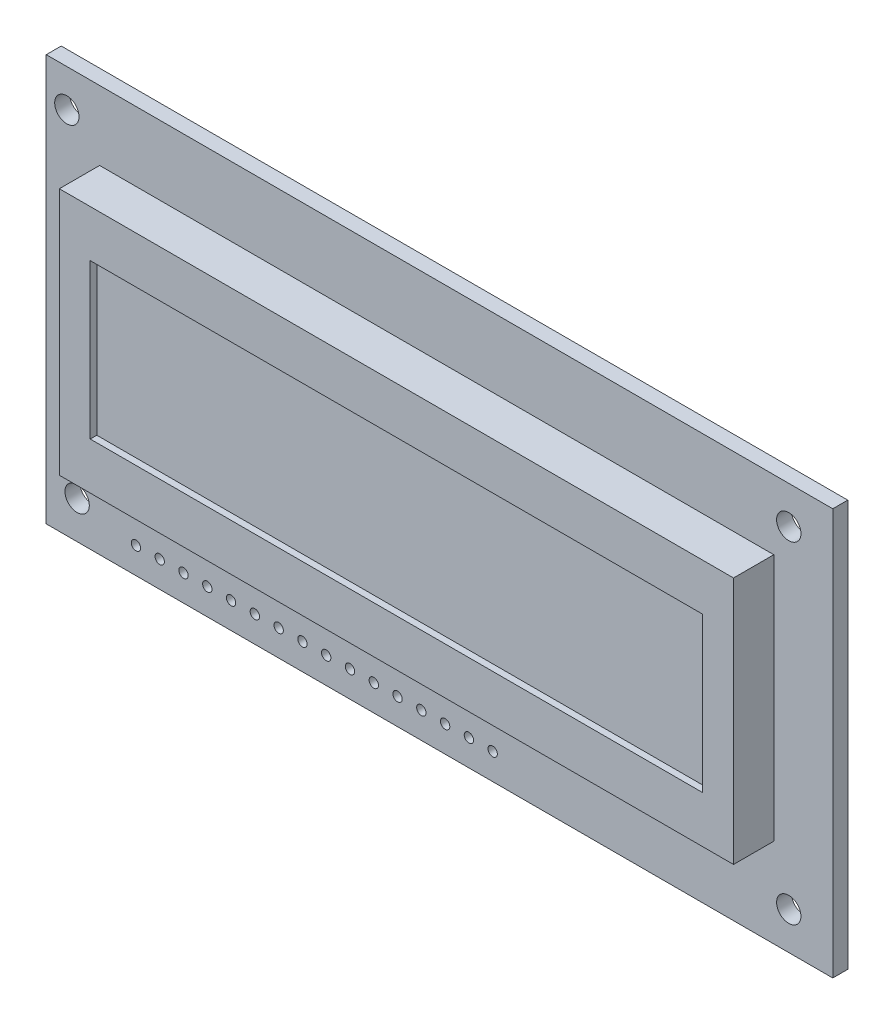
ISO-10303-21;
HEADER;
FILE_DESCRIPTION(('STEP AP214'),'2;1');
FILE_NAME('part.step','',(''),(''),'','','');
FILE_SCHEMA(('AUTOMOTIVE_DESIGN { 1 0 10303 214 1 1 1 1 }'));
ENDSEC;
DATA;
#1=APPLICATION_CONTEXT('core data for automotive mechanical design processes');
#2=APPLICATION_PROTOCOL_DEFINITION('international standard','automotive_design',2000,#1);
#3=PRODUCT_CONTEXT('',#1,'mechanical');
#4=PRODUCT('Part','Part','',(#3));
#5=PRODUCT_RELATED_PRODUCT_CATEGORY('part','',(#4));
#6=PRODUCT_DEFINITION_FORMATION('','',#4);
#7=PRODUCT_DEFINITION_CONTEXT('part definition',#1,'design');
#8=PRODUCT_DEFINITION('design','',#6,#7);
#9=PRODUCT_DEFINITION_SHAPE('','',#8);
#10=(LENGTH_UNIT() NAMED_UNIT(*) SI_UNIT(.MILLI.,.METRE.));
#11=(NAMED_UNIT(*) PLANE_ANGLE_UNIT() SI_UNIT($,.RADIAN.));
#12=(NAMED_UNIT(*) SI_UNIT($,.STERADIAN.) SOLID_ANGLE_UNIT());
#13=UNCERTAINTY_MEASURE_WITH_UNIT(LENGTH_MEASURE(1.E-05),#10,'distance_accuracy_value','');
#14=(GEOMETRIC_REPRESENTATION_CONTEXT(3) GLOBAL_UNCERTAINTY_ASSIGNED_CONTEXT((#13)) GLOBAL_UNIT_ASSIGNED_CONTEXT((#10,
#11,#12)) REPRESENTATION_CONTEXT('',''));
#15=CARTESIAN_POINT('',(0.,0.,0.));
#16=DIRECTION('',(0.,0.,1.));
#17=DIRECTION('',(1.,0.,0.));
#18=AXIS2_PLACEMENT_3D('',#15,#16,#17);
#19=CARTESIAN_POINT('',(92.2,43.4,1.6));
#20=DIRECTION('',(0.,0.,-1.));
#21=DIRECTION('',(-1.,0.,0.));
#22=AXIS2_PLACEMENT_3D('',#19,#20,#21);
#23=PLANE('',#22);
#24=CARTESIAN_POINT('',(55.88,2.8,1.6));
#25=DIRECTION('',(0.,0.,1.));
#26=DIRECTION('',(1.,0.,0.));
#27=AXIS2_PLACEMENT_3D('',#24,#25,#26);
#28=CIRCLE('',#27,0.499999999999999);
#29=CARTESIAN_POINT('',(56.38,2.8,1.6));
#30=VERTEX_POINT('',#29);
#31=EDGE_CURVE('E197',#30,#30,#28,.T.);
#32=ORIENTED_EDGE('',*,*,#31,.F.);
#33=EDGE_LOOP('',(#32));
#34=FACE_BOUND('',#33,.T.);
#35=CARTESIAN_POINT('',(50.8,2.8,1.6));
#36=DIRECTION('',(0.,0.,1.));
#37=DIRECTION('',(1.,0.,0.));
#38=AXIS2_PLACEMENT_3D('',#35,#36,#37);
#39=CIRCLE('',#38,0.499999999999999);
#40=CARTESIAN_POINT('',(51.3,2.8,1.6));
#41=VERTEX_POINT('',#40);
#42=EDGE_CURVE('E209',#41,#41,#39,.T.);
#43=ORIENTED_EDGE('',*,*,#42,.F.);
#44=EDGE_LOOP('',(#43));
#45=FACE_BOUND('',#44,.T.);
#46=CARTESIAN_POINT('',(45.72,2.8,1.6));
#47=DIRECTION('',(0.,0.,1.));
#48=DIRECTION('',(1.,0.,0.));
#49=AXIS2_PLACEMENT_3D('',#46,#47,#48);
#50=CIRCLE('',#49,0.499999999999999);
#51=CARTESIAN_POINT('',(46.22,2.8,1.6));
#52=VERTEX_POINT('',#51);
#53=EDGE_CURVE('E221',#52,#52,#50,.T.);
#54=ORIENTED_EDGE('',*,*,#53,.F.);
#55=EDGE_LOOP('',(#54));
#56=FACE_BOUND('',#55,.T.);
#57=CARTESIAN_POINT('',(40.64,2.8,1.6));
#58=DIRECTION('',(0.,0.,1.));
#59=DIRECTION('',(1.,0.,0.));
#60=AXIS2_PLACEMENT_3D('',#57,#58,#59);
#61=CIRCLE('',#60,0.499999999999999);
#62=CARTESIAN_POINT('',(41.14,2.8,1.6));
#63=VERTEX_POINT('',#62);
#64=EDGE_CURVE('E233',#63,#63,#61,.T.);
#65=ORIENTED_EDGE('',*,*,#64,.F.);
#66=EDGE_LOOP('',(#65));
#67=FACE_BOUND('',#66,.T.);
#68=CARTESIAN_POINT('',(35.56,2.8,1.6));
#69=DIRECTION('',(0.,0.,1.));
#70=DIRECTION('',(1.,0.,0.));
#71=AXIS2_PLACEMENT_3D('',#68,#69,#70);
#72=CIRCLE('',#71,0.499999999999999);
#73=CARTESIAN_POINT('',(36.06,2.8,1.6));
#74=VERTEX_POINT('',#73);
#75=EDGE_CURVE('E245',#74,#74,#72,.T.);
#76=ORIENTED_EDGE('',*,*,#75,.F.);
#77=EDGE_LOOP('',(#76));
#78=FACE_BOUND('',#77,.T.);
#79=CARTESIAN_POINT('',(30.48,2.8,1.6));
#80=DIRECTION('',(0.,0.,1.));
#81=DIRECTION('',(1.,0.,0.));
#82=AXIS2_PLACEMENT_3D('',#79,#80,#81);
#83=CIRCLE('',#82,0.499999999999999);
#84=CARTESIAN_POINT('',(30.98,2.8,1.6));
#85=VERTEX_POINT('',#84);
#86=EDGE_CURVE('E257',#85,#85,#83,.T.);
#87=ORIENTED_EDGE('',*,*,#86,.F.);
#88=EDGE_LOOP('',(#87));
#89=FACE_BOUND('',#88,.T.);
#90=CARTESIAN_POINT('',(25.4,2.8,1.6));
#91=DIRECTION('',(0.,0.,1.));
#92=DIRECTION('',(1.,0.,0.));
#93=AXIS2_PLACEMENT_3D('',#90,#91,#92);
#94=CIRCLE('',#93,0.499999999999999);
#95=CARTESIAN_POINT('',(25.9,2.8,1.6));
#96=VERTEX_POINT('',#95);
#97=EDGE_CURVE('E269',#96,#96,#94,.T.);
#98=ORIENTED_EDGE('',*,*,#97,.F.);
#99=EDGE_LOOP('',(#98));
#100=FACE_BOUND('',#99,.T.);
#101=CARTESIAN_POINT('',(20.32,2.8,1.6));
#102=DIRECTION('',(0.,0.,1.));
#103=DIRECTION('',(1.,0.,0.));
#104=AXIS2_PLACEMENT_3D('',#101,#102,#103);
#105=CIRCLE('',#104,0.499999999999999);
#106=CARTESIAN_POINT('',(20.82,2.8,1.6));
#107=VERTEX_POINT('',#106);
#108=EDGE_CURVE('E281',#107,#107,#105,.T.);
#109=ORIENTED_EDGE('',*,*,#108,.F.);
#110=EDGE_LOOP('',(#109));
#111=FACE_BOUND('',#110,.T.);
#112=CARTESIAN_POINT('',(87.5,39.4,1.6));
#113=DIRECTION('',(0.,0.,1.));
#114=DIRECTION('',(-1.,0.,0.));
#115=AXIS2_PLACEMENT_3D('',#112,#113,#114);
#116=CIRCLE('',#115,1.3);
#117=CARTESIAN_POINT('',(86.2,39.4,1.6));
#118=VERTEX_POINT('',#117);
#119=EDGE_CURVE('E293',#118,#118,#116,.T.);
#120=ORIENTED_EDGE('',*,*,#119,.F.);
#121=EDGE_LOOP('',(#120));
#122=FACE_BOUND('',#121,.T.);
#123=CARTESIAN_POINT('',(87.5,4.,1.6));
#124=DIRECTION('',(0.,0.,1.));
#125=DIRECTION('',(1.,0.,0.));
#126=AXIS2_PLACEMENT_3D('',#123,#124,#125);
#127=CIRCLE('',#126,1.29999999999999);
#128=CARTESIAN_POINT('',(88.8,4.,1.6));
#129=VERTEX_POINT('',#128);
#130=EDGE_CURVE('E305',#129,#129,#127,.T.);
#131=ORIENTED_EDGE('',*,*,#130,.F.);
#132=EDGE_LOOP('',(#131));
#133=FACE_BOUND('',#132,.T.);
#134=DIRECTION('',(0.,1.,0.));
#135=VECTOR('',#134,1.);
#136=CARTESIAN_POINT('',(92.2,0.,1.6));
#137=LINE('',#136,#135);
#138=CARTESIAN_POINT('',(92.2,0.,1.6));
#139=VERTEX_POINT('',#138);
#140=CARTESIAN_POINT('',(92.2,43.4,1.6));
#141=VERTEX_POINT('',#140);
#142=EDGE_CURVE('E323',#139,#141,#137,.T.);
#143=ORIENTED_EDGE('',*,*,#142,.T.);
#144=DIRECTION('',(-1.,0.,0.));
#145=VECTOR('',#144,1.);
#146=CARTESIAN_POINT('',(8.2,43.4,1.6));
#147=LINE('',#146,#145);
#148=CARTESIAN_POINT('',(8.2,43.4,1.6));
#149=VERTEX_POINT('',#148);
#150=EDGE_CURVE('E326',#141,#149,#147,.T.);
#151=ORIENTED_EDGE('',*,*,#150,.T.);
#152=DIRECTION('',(0.,-1.,0.));
#153=VECTOR('',#152,1.);
#154=CARTESIAN_POINT('',(8.2,43.4,1.6));
#155=LINE('',#154,#153);
#156=CARTESIAN_POINT('',(8.2,0.,1.6));
#157=VERTEX_POINT('',#156);
#158=EDGE_CURVE('E328',#149,#157,#155,.T.);
#159=ORIENTED_EDGE('',*,*,#158,.T.);
#160=DIRECTION('',(1.,0.,0.));
#161=VECTOR('',#160,1.);
#162=CARTESIAN_POINT('',(8.2,0.,1.6));
#163=LINE('',#162,#161);
#164=EDGE_CURVE('E330',#157,#139,#163,.T.);
#165=ORIENTED_EDGE('',*,*,#164,.T.);
#166=EDGE_LOOP('',(#143,#151,#159,#165));
#167=FACE_BOUND('',#166,.T.);
#168=CARTESIAN_POINT('',(11.5,4.,1.6));
#169=DIRECTION('',(0.,0.,1.));
#170=DIRECTION('',(1.,0.,0.));
#171=AXIS2_PLACEMENT_3D('',#168,#169,#170);
#172=CIRCLE('',#171,1.3);
#173=CARTESIAN_POINT('',(12.8,4.,1.6));
#174=VERTEX_POINT('',#173);
#175=EDGE_CURVE('E311',#174,#174,#172,.T.);
#176=ORIENTED_EDGE('',*,*,#175,.F.);
#177=EDGE_LOOP('',(#176));
#178=FACE_BOUND('',#177,.T.);
#179=CARTESIAN_POINT('',(10.4,39.3999999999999,1.6));
#180=DIRECTION('',(0.,0.,1.));
#181=DIRECTION('',(1.,0.,0.));
#182=AXIS2_PLACEMENT_3D('',#179,#180,#181);
#183=CIRCLE('',#182,1.3);
#184=CARTESIAN_POINT('',(11.7,39.3999999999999,1.6));
#185=VERTEX_POINT('',#184);
#186=EDGE_CURVE('E299',#185,#185,#183,.T.);
#187=ORIENTED_EDGE('',*,*,#186,.F.);
#188=EDGE_LOOP('',(#187));
#189=FACE_BOUND('',#188,.T.);
#190=CARTESIAN_POINT('',(17.78,2.8,1.6));
#191=DIRECTION('',(0.,0.,1.));
#192=DIRECTION('',(1.,0.,0.));
#193=AXIS2_PLACEMENT_3D('',#190,#191,#192);
#194=CIRCLE('',#193,0.499999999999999);
#195=CARTESIAN_POINT('',(18.28,2.8,1.6));
#196=VERTEX_POINT('',#195);
#197=EDGE_CURVE('E287',#196,#196,#194,.T.);
#198=ORIENTED_EDGE('',*,*,#197,.F.);
#199=EDGE_LOOP('',(#198));
#200=FACE_BOUND('',#199,.T.);
#201=CARTESIAN_POINT('',(22.86,2.8,1.6));
#202=DIRECTION('',(0.,0.,1.));
#203=DIRECTION('',(1.,0.,0.));
#204=AXIS2_PLACEMENT_3D('',#201,#202,#203);
#205=CIRCLE('',#204,0.499999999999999);
#206=CARTESIAN_POINT('',(23.36,2.8,1.6));
#207=VERTEX_POINT('',#206);
#208=EDGE_CURVE('E275',#207,#207,#205,.T.);
#209=ORIENTED_EDGE('',*,*,#208,.F.);
#210=EDGE_LOOP('',(#209));
#211=FACE_BOUND('',#210,.T.);
#212=CARTESIAN_POINT('',(27.94,2.8,1.6));
#213=DIRECTION('',(0.,0.,1.));
#214=DIRECTION('',(1.,0.,0.));
#215=AXIS2_PLACEMENT_3D('',#212,#213,#214);
#216=CIRCLE('',#215,0.499999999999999);
#217=CARTESIAN_POINT('',(28.44,2.8,1.6));
#218=VERTEX_POINT('',#217);
#219=EDGE_CURVE('E263',#218,#218,#216,.T.);
#220=ORIENTED_EDGE('',*,*,#219,.F.);
#221=EDGE_LOOP('',(#220));
#222=FACE_BOUND('',#221,.T.);
#223=CARTESIAN_POINT('',(33.02,2.8,1.6));
#224=DIRECTION('',(0.,0.,1.));
#225=DIRECTION('',(1.,0.,0.));
#226=AXIS2_PLACEMENT_3D('',#223,#224,#225);
#227=CIRCLE('',#226,0.499999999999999);
#228=CARTESIAN_POINT('',(33.52,2.8,1.6));
#229=VERTEX_POINT('',#228);
#230=EDGE_CURVE('E251',#229,#229,#227,.T.);
#231=ORIENTED_EDGE('',*,*,#230,.F.);
#232=EDGE_LOOP('',(#231));
#233=FACE_BOUND('',#232,.T.);
#234=CARTESIAN_POINT('',(38.1,2.8,1.6));
#235=DIRECTION('',(0.,0.,1.));
#236=DIRECTION('',(1.,0.,0.));
#237=AXIS2_PLACEMENT_3D('',#234,#235,#236);
#238=CIRCLE('',#237,0.499999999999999);
#239=CARTESIAN_POINT('',(38.6,2.8,1.6));
#240=VERTEX_POINT('',#239);
#241=EDGE_CURVE('E239',#240,#240,#238,.T.);
#242=ORIENTED_EDGE('',*,*,#241,.F.);
#243=EDGE_LOOP('',(#242));
#244=FACE_BOUND('',#243,.T.);
#245=CARTESIAN_POINT('',(43.18,2.8,1.6));
#246=DIRECTION('',(0.,0.,1.));
#247=DIRECTION('',(1.,0.,0.));
#248=AXIS2_PLACEMENT_3D('',#245,#246,#247);
#249=CIRCLE('',#248,0.499999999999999);
#250=CARTESIAN_POINT('',(43.68,2.8,1.6));
#251=VERTEX_POINT('',#250);
#252=EDGE_CURVE('E227',#251,#251,#249,.T.);
#253=ORIENTED_EDGE('',*,*,#252,.F.);
#254=EDGE_LOOP('',(#253));
#255=FACE_BOUND('',#254,.T.);
#256=CARTESIAN_POINT('',(48.26,2.8,1.6));
#257=DIRECTION('',(0.,0.,1.));
#258=DIRECTION('',(1.,0.,0.));
#259=AXIS2_PLACEMENT_3D('',#256,#257,#258);
#260=CIRCLE('',#259,0.499999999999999);
#261=CARTESIAN_POINT('',(48.76,2.8,1.6));
#262=VERTEX_POINT('',#261);
#263=EDGE_CURVE('E215',#262,#262,#260,.T.);
#264=ORIENTED_EDGE('',*,*,#263,.F.);
#265=EDGE_LOOP('',(#264));
#266=FACE_BOUND('',#265,.T.);
#267=CARTESIAN_POINT('',(53.34,2.8,1.6));
#268=DIRECTION('',(0.,0.,1.));
#269=DIRECTION('',(1.,0.,0.));
#270=AXIS2_PLACEMENT_3D('',#267,#268,#269);
#271=CIRCLE('',#270,0.499999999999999);
#272=CARTESIAN_POINT('',(53.84,2.8,1.6));
#273=VERTEX_POINT('',#272);
#274=EDGE_CURVE('E203',#273,#273,#271,.T.);
#275=ORIENTED_EDGE('',*,*,#274,.F.);
#276=EDGE_LOOP('',(#275));
#277=FACE_BOUND('',#276,.T.);
#278=DIRECTION('',(0.,-1.,0.));
#279=VECTOR('',#278,1.);
#280=CARTESIAN_POINT('',(13.9,36.,1.6));
#281=LINE('',#280,#279);
#282=CARTESIAN_POINT('',(13.9,36.,1.6));
#283=VERTEX_POINT('',#282);
#284=CARTESIAN_POINT('',(13.9,9.5,1.6));
#285=VERTEX_POINT('',#284);
#286=EDGE_CURVE('E162',#283,#285,#281,.T.);
#287=ORIENTED_EDGE('',*,*,#286,.F.);
#288=DIRECTION('',(-1.,0.,0.));
#289=VECTOR('',#288,1.);
#290=CARTESIAN_POINT('',(13.9,36.,1.6));
#291=LINE('',#290,#289);
#292=CARTESIAN_POINT('',(85.9,36.,1.6));
#293=VERTEX_POINT('',#292);
#294=EDGE_CURVE('E171',#293,#283,#291,.T.);
#295=ORIENTED_EDGE('',*,*,#294,.F.);
#296=DIRECTION('',(0.,1.,0.));
#297=VECTOR('',#296,1.);
#298=CARTESIAN_POINT('',(85.9,36.,1.6));
#299=LINE('',#298,#297);
#300=CARTESIAN_POINT('',(85.9,9.50000000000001,1.6));
#301=VERTEX_POINT('',#300);
#302=EDGE_CURVE('E168',#301,#293,#299,.T.);
#303=ORIENTED_EDGE('',*,*,#302,.F.);
#304=DIRECTION('',(1.,0.,0.));
#305=VECTOR('',#304,1.);
#306=CARTESIAN_POINT('',(13.9,9.50000000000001,1.6));
#307=LINE('',#306,#305);
#308=EDGE_CURVE('E58',#285,#301,#307,.T.);
#309=ORIENTED_EDGE('',*,*,#308,.F.);
#310=EDGE_LOOP('',(#287,#295,#303,#309));
#311=FACE_BOUND('',#310,.T.);
#312=ADVANCED_FACE('F35',(#34,#45,#56,#67,#78,#89,#100,#111,#122,#133,#167,#178,#189,#200,#211,
#222,#233,#244,#255,#266,#277,#311),#23,.F.);
#313=CARTESIAN_POINT('',(92.2,43.4,0.));
#314=DIRECTION('',(0.,0.,-1.));
#315=DIRECTION('',(-1.,0.,0.));
#316=AXIS2_PLACEMENT_3D('',#313,#314,#315);
#317=PLANE('',#316);
#318=CARTESIAN_POINT('',(53.34,2.8,0.));
#319=DIRECTION('',(0.,0.,1.));
#320=DIRECTION('',(1.,0.,0.));
#321=AXIS2_PLACEMENT_3D('',#318,#319,#320);
#322=CIRCLE('',#321,0.499999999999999);
#323=CARTESIAN_POINT('',(53.84,2.8,0.));
#324=VERTEX_POINT('',#323);
#325=EDGE_CURVE('E200',#324,#324,#322,.T.);
#326=ORIENTED_EDGE('',*,*,#325,.T.);
#327=EDGE_LOOP('',(#326));
#328=FACE_BOUND('',#327,.T.);
#329=CARTESIAN_POINT('',(48.26,2.8,0.));
#330=DIRECTION('',(0.,0.,1.));
#331=DIRECTION('',(1.,0.,0.));
#332=AXIS2_PLACEMENT_3D('',#329,#330,#331);
#333=CIRCLE('',#332,0.499999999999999);
#334=CARTESIAN_POINT('',(48.76,2.8,0.));
#335=VERTEX_POINT('',#334);
#336=EDGE_CURVE('E212',#335,#335,#333,.T.);
#337=ORIENTED_EDGE('',*,*,#336,.T.);
#338=EDGE_LOOP('',(#337));
#339=FACE_BOUND('',#338,.T.);
#340=CARTESIAN_POINT('',(43.18,2.8,0.));
#341=DIRECTION('',(0.,0.,1.));
#342=DIRECTION('',(1.,0.,0.));
#343=AXIS2_PLACEMENT_3D('',#340,#341,#342);
#344=CIRCLE('',#343,0.499999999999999);
#345=CARTESIAN_POINT('',(43.68,2.8,0.));
#346=VERTEX_POINT('',#345);
#347=EDGE_CURVE('E224',#346,#346,#344,.T.);
#348=ORIENTED_EDGE('',*,*,#347,.T.);
#349=EDGE_LOOP('',(#348));
#350=FACE_BOUND('',#349,.T.);
#351=CARTESIAN_POINT('',(38.1,2.8,0.));
#352=DIRECTION('',(0.,0.,1.));
#353=DIRECTION('',(1.,0.,0.));
#354=AXIS2_PLACEMENT_3D('',#351,#352,#353);
#355=CIRCLE('',#354,0.499999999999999);
#356=CARTESIAN_POINT('',(38.6,2.8,0.));
#357=VERTEX_POINT('',#356);
#358=EDGE_CURVE('E236',#357,#357,#355,.T.);
#359=ORIENTED_EDGE('',*,*,#358,.T.);
#360=EDGE_LOOP('',(#359));
#361=FACE_BOUND('',#360,.T.);
#362=CARTESIAN_POINT('',(33.02,2.8,0.));
#363=DIRECTION('',(0.,0.,1.));
#364=DIRECTION('',(1.,0.,0.));
#365=AXIS2_PLACEMENT_3D('',#362,#363,#364);
#366=CIRCLE('',#365,0.499999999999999);
#367=CARTESIAN_POINT('',(33.52,2.8,0.));
#368=VERTEX_POINT('',#367);
#369=EDGE_CURVE('E248',#368,#368,#366,.T.);
#370=ORIENTED_EDGE('',*,*,#369,.T.);
#371=EDGE_LOOP('',(#370));
#372=FACE_BOUND('',#371,.T.);
#373=CARTESIAN_POINT('',(27.94,2.8,0.));
#374=DIRECTION('',(0.,0.,1.));
#375=DIRECTION('',(1.,0.,0.));
#376=AXIS2_PLACEMENT_3D('',#373,#374,#375);
#377=CIRCLE('',#376,0.499999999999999);
#378=CARTESIAN_POINT('',(28.44,2.8,0.));
#379=VERTEX_POINT('',#378);
#380=EDGE_CURVE('E260',#379,#379,#377,.T.);
#381=ORIENTED_EDGE('',*,*,#380,.T.);
#382=EDGE_LOOP('',(#381));
#383=FACE_BOUND('',#382,.T.);
#384=CARTESIAN_POINT('',(22.86,2.8,0.));
#385=DIRECTION('',(0.,0.,1.));
#386=DIRECTION('',(1.,0.,0.));
#387=AXIS2_PLACEMENT_3D('',#384,#385,#386);
#388=CIRCLE('',#387,0.499999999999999);
#389=CARTESIAN_POINT('',(23.36,2.8,0.));
#390=VERTEX_POINT('',#389);
#391=EDGE_CURVE('E272',#390,#390,#388,.T.);
#392=ORIENTED_EDGE('',*,*,#391,.T.);
#393=EDGE_LOOP('',(#392));
#394=FACE_BOUND('',#393,.T.);
#395=CARTESIAN_POINT('',(17.78,2.8,0.));
#396=DIRECTION('',(0.,0.,1.));
#397=DIRECTION('',(1.,0.,0.));
#398=AXIS2_PLACEMENT_3D('',#395,#396,#397);
#399=CIRCLE('',#398,0.499999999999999);
#400=CARTESIAN_POINT('',(18.28,2.8,0.));
#401=VERTEX_POINT('',#400);
#402=EDGE_CURVE('E284',#401,#401,#399,.T.);
#403=ORIENTED_EDGE('',*,*,#402,.T.);
#404=EDGE_LOOP('',(#403));
#405=FACE_BOUND('',#404,.T.);
#406=CARTESIAN_POINT('',(10.4,39.3999999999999,0.));
#407=DIRECTION('',(0.,0.,1.));
#408=DIRECTION('',(1.,0.,0.));
#409=AXIS2_PLACEMENT_3D('',#406,#407,#408);
#410=CIRCLE('',#409,1.3);
#411=CARTESIAN_POINT('',(11.7,39.3999999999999,0.));
#412=VERTEX_POINT('',#411);
#413=EDGE_CURVE('E296',#412,#412,#410,.T.);
#414=ORIENTED_EDGE('',*,*,#413,.T.);
#415=EDGE_LOOP('',(#414));
#416=FACE_BOUND('',#415,.T.);
#417=CARTESIAN_POINT('',(11.5,4.,0.));
#418=DIRECTION('',(0.,0.,1.));
#419=DIRECTION('',(1.,0.,0.));
#420=AXIS2_PLACEMENT_3D('',#417,#418,#419);
#421=CIRCLE('',#420,1.3);
#422=CARTESIAN_POINT('',(12.8,4.,0.));
#423=VERTEX_POINT('',#422);
#424=EDGE_CURVE('E308',#423,#423,#421,.T.);
#425=ORIENTED_EDGE('',*,*,#424,.T.);
#426=EDGE_LOOP('',(#425));
#427=FACE_BOUND('',#426,.T.);
#428=DIRECTION('',(0.,1.,0.));
#429=VECTOR('',#428,1.);
#430=CARTESIAN_POINT('',(92.2,0.,0.));
#431=LINE('',#430,#429);
#432=CARTESIAN_POINT('',(92.2,0.,0.));
#433=VERTEX_POINT('',#432);
#434=CARTESIAN_POINT('',(92.2,43.4,0.));
#435=VERTEX_POINT('',#434);
#436=EDGE_CURVE('E314',#433,#435,#431,.T.);
#437=ORIENTED_EDGE('',*,*,#436,.F.);
#438=DIRECTION('',(1.,0.,0.));
#439=VECTOR('',#438,1.);
#440=CARTESIAN_POINT('',(8.2,0.,0.));
#441=LINE('',#440,#439);
#442=CARTESIAN_POINT('',(8.2,0.,0.));
#443=VERTEX_POINT('',#442);
#444=EDGE_CURVE('E321',#443,#433,#441,.T.);
#445=ORIENTED_EDGE('',*,*,#444,.F.);
#446=DIRECTION('',(0.,-1.,0.));
#447=VECTOR('',#446,1.);
#448=CARTESIAN_POINT('',(8.2,43.4,0.));
#449=LINE('',#448,#447);
#450=CARTESIAN_POINT('',(8.2,43.4,0.));
#451=VERTEX_POINT('',#450);
#452=EDGE_CURVE('E319',#451,#443,#449,.T.);
#453=ORIENTED_EDGE('',*,*,#452,.F.);
#454=DIRECTION('',(-1.,0.,0.));
#455=VECTOR('',#454,1.);
#456=CARTESIAN_POINT('',(8.2,43.4,0.));
#457=LINE('',#456,#455);
#458=EDGE_CURVE('E317',#435,#451,#457,.T.);
#459=ORIENTED_EDGE('',*,*,#458,.F.);
#460=EDGE_LOOP('',(#437,#445,#453,#459));
#461=FACE_BOUND('',#460,.T.);
#462=CARTESIAN_POINT('',(87.5,4.,0.));
#463=DIRECTION('',(0.,0.,1.));
#464=DIRECTION('',(1.,0.,0.));
#465=AXIS2_PLACEMENT_3D('',#462,#463,#464);
#466=CIRCLE('',#465,1.29999999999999);
#467=CARTESIAN_POINT('',(88.8,4.,0.));
#468=VERTEX_POINT('',#467);
#469=EDGE_CURVE('E302',#468,#468,#466,.T.);
#470=ORIENTED_EDGE('',*,*,#469,.T.);
#471=EDGE_LOOP('',(#470));
#472=FACE_BOUND('',#471,.T.);
#473=CARTESIAN_POINT('',(87.5,39.4,0.));
#474=DIRECTION('',(0.,0.,1.));
#475=DIRECTION('',(-1.,0.,0.));
#476=AXIS2_PLACEMENT_3D('',#473,#474,#475);
#477=CIRCLE('',#476,1.3);
#478=CARTESIAN_POINT('',(86.2,39.4,0.));
#479=VERTEX_POINT('',#478);
#480=EDGE_CURVE('E290',#479,#479,#477,.T.);
#481=ORIENTED_EDGE('',*,*,#480,.T.);
#482=EDGE_LOOP('',(#481));
#483=FACE_BOUND('',#482,.T.);
#484=CARTESIAN_POINT('',(20.32,2.8,0.));
#485=DIRECTION('',(0.,0.,1.));
#486=DIRECTION('',(1.,0.,0.));
#487=AXIS2_PLACEMENT_3D('',#484,#485,#486);
#488=CIRCLE('',#487,0.499999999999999);
#489=CARTESIAN_POINT('',(20.82,2.8,0.));
#490=VERTEX_POINT('',#489);
#491=EDGE_CURVE('E278',#490,#490,#488,.T.);
#492=ORIENTED_EDGE('',*,*,#491,.T.);
#493=EDGE_LOOP('',(#492));
#494=FACE_BOUND('',#493,.T.);
#495=CARTESIAN_POINT('',(25.4,2.8,0.));
#496=DIRECTION('',(0.,0.,1.));
#497=DIRECTION('',(1.,0.,0.));
#498=AXIS2_PLACEMENT_3D('',#495,#496,#497);
#499=CIRCLE('',#498,0.499999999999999);
#500=CARTESIAN_POINT('',(25.9,2.8,0.));
#501=VERTEX_POINT('',#500);
#502=EDGE_CURVE('E266',#501,#501,#499,.T.);
#503=ORIENTED_EDGE('',*,*,#502,.T.);
#504=EDGE_LOOP('',(#503));
#505=FACE_BOUND('',#504,.T.);
#506=CARTESIAN_POINT('',(30.48,2.8,0.));
#507=DIRECTION('',(0.,0.,1.));
#508=DIRECTION('',(1.,0.,0.));
#509=AXIS2_PLACEMENT_3D('',#506,#507,#508);
#510=CIRCLE('',#509,0.499999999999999);
#511=CARTESIAN_POINT('',(30.98,2.8,0.));
#512=VERTEX_POINT('',#511);
#513=EDGE_CURVE('E254',#512,#512,#510,.T.);
#514=ORIENTED_EDGE('',*,*,#513,.T.);
#515=EDGE_LOOP('',(#514));
#516=FACE_BOUND('',#515,.T.);
#517=CARTESIAN_POINT('',(35.56,2.8,0.));
#518=DIRECTION('',(0.,0.,1.));
#519=DIRECTION('',(1.,0.,0.));
#520=AXIS2_PLACEMENT_3D('',#517,#518,#519);
#521=CIRCLE('',#520,0.499999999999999);
#522=CARTESIAN_POINT('',(36.06,2.8,0.));
#523=VERTEX_POINT('',#522);
#524=EDGE_CURVE('E242',#523,#523,#521,.T.);
#525=ORIENTED_EDGE('',*,*,#524,.T.);
#526=EDGE_LOOP('',(#525));
#527=FACE_BOUND('',#526,.T.);
#528=CARTESIAN_POINT('',(40.64,2.8,0.));
#529=DIRECTION('',(0.,0.,1.));
#530=DIRECTION('',(1.,0.,0.));
#531=AXIS2_PLACEMENT_3D('',#528,#529,#530);
#532=CIRCLE('',#531,0.499999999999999);
#533=CARTESIAN_POINT('',(41.14,2.8,0.));
#534=VERTEX_POINT('',#533);
#535=EDGE_CURVE('E230',#534,#534,#532,.T.);
#536=ORIENTED_EDGE('',*,*,#535,.T.);
#537=EDGE_LOOP('',(#536));
#538=FACE_BOUND('',#537,.T.);
#539=CARTESIAN_POINT('',(45.72,2.8,0.));
#540=DIRECTION('',(0.,0.,1.));
#541=DIRECTION('',(1.,0.,0.));
#542=AXIS2_PLACEMENT_3D('',#539,#540,#541);
#543=CIRCLE('',#542,0.499999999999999);
#544=CARTESIAN_POINT('',(46.22,2.8,0.));
#545=VERTEX_POINT('',#544);
#546=EDGE_CURVE('E218',#545,#545,#543,.T.);
#547=ORIENTED_EDGE('',*,*,#546,.T.);
#548=EDGE_LOOP('',(#547));
#549=FACE_BOUND('',#548,.T.);
#550=CARTESIAN_POINT('',(50.8,2.8,0.));
#551=DIRECTION('',(0.,0.,1.));
#552=DIRECTION('',(1.,0.,0.));
#553=AXIS2_PLACEMENT_3D('',#550,#551,#552);
#554=CIRCLE('',#553,0.499999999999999);
#555=CARTESIAN_POINT('',(51.3,2.8,0.));
#556=VERTEX_POINT('',#555);
#557=EDGE_CURVE('E206',#556,#556,#554,.T.);
#558=ORIENTED_EDGE('',*,*,#557,.T.);
#559=EDGE_LOOP('',(#558));
#560=FACE_BOUND('',#559,.T.);
#561=CARTESIAN_POINT('',(55.88,2.8,0.));
#562=DIRECTION('',(0.,0.,1.));
#563=DIRECTION('',(1.,0.,0.));
#564=AXIS2_PLACEMENT_3D('',#561,#562,#563);
#565=CIRCLE('',#564,0.499999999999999);
#566=CARTESIAN_POINT('',(56.38,2.8,0.));
#567=VERTEX_POINT('',#566);
#568=EDGE_CURVE('E194',#567,#567,#565,.T.);
#569=ORIENTED_EDGE('',*,*,#568,.T.);
#570=EDGE_LOOP('',(#569));
#571=FACE_BOUND('',#570,.T.);
#572=ADVANCED_FACE('F348',(#328,#339,#350,#361,#372,#383,#394,#405,#416,#427,#461,#472,#483,
#494,#505,#516,#527,#538,#549,#560,#571),#317,.T.);
#573=CARTESIAN_POINT('',(92.2,0.,1.6));
#574=DIRECTION('',(-1.,0.,0.));
#575=DIRECTION('',(0.,0.,1.));
#576=AXIS2_PLACEMENT_3D('',#573,#574,#575);
#577=PLANE('',#576);
#578=ORIENTED_EDGE('',*,*,#436,.T.);
#579=DIRECTION('',(0.,0.,-1.));
#580=VECTOR('',#579,1.);
#581=CARTESIAN_POINT('',(92.2,43.4,1.6));
#582=LINE('',#581,#580);
#583=EDGE_CURVE('E11',#141,#435,#582,.T.);
#584=ORIENTED_EDGE('',*,*,#583,.F.);
#585=ORIENTED_EDGE('',*,*,#142,.F.);
#586=DIRECTION('',(0.,0.,-1.));
#587=VECTOR('',#586,1.);
#588=CARTESIAN_POINT('',(92.2,0.,1.6));
#589=LINE('',#588,#587);
#590=EDGE_CURVE('E332',#139,#433,#589,.T.);
#591=ORIENTED_EDGE('',*,*,#590,.T.);
#592=EDGE_LOOP('',(#578,#584,#585,#591));
#593=FACE_BOUND('',#592,.T.);
#594=ADVANCED_FACE('F37',(#593),#577,.F.);
#595=CARTESIAN_POINT('',(8.2,43.4,1.6));
#596=DIRECTION('',(0.,-1.,0.));
#597=DIRECTION('',(0.,0.,-1.));
#598=AXIS2_PLACEMENT_3D('',#595,#596,#597);
#599=PLANE('',#598);
#600=ORIENTED_EDGE('',*,*,#458,.T.);
#601=DIRECTION('',(0.,0.,-1.));
#602=VECTOR('',#601,1.);
#603=CARTESIAN_POINT('',(8.2,43.4,1.6));
#604=LINE('',#603,#602);
#605=EDGE_CURVE('E43',#149,#451,#604,.T.);
#606=ORIENTED_EDGE('',*,*,#605,.F.);
#607=ORIENTED_EDGE('',*,*,#150,.F.);
#608=ORIENTED_EDGE('',*,*,#583,.T.);
#609=EDGE_LOOP('',(#600,#606,#607,#608));
#610=FACE_BOUND('',#609,.T.);
#611=ADVANCED_FACE('F359',(#610),#599,.F.);
#612=CARTESIAN_POINT('',(8.2,43.4,1.6));
#613=DIRECTION('',(1.,0.,0.));
#614=DIRECTION('',(0.,0.,-1.));
#615=AXIS2_PLACEMENT_3D('',#612,#613,#614);
#616=PLANE('',#615);
#617=ORIENTED_EDGE('',*,*,#452,.T.);
#618=DIRECTION('',(0.,0.,-1.));
#619=VECTOR('',#618,1.);
#620=CARTESIAN_POINT('',(8.2,0.,1.6));
#621=LINE('',#620,#619);
#622=EDGE_CURVE('E335',#157,#443,#621,.T.);
#623=ORIENTED_EDGE('',*,*,#622,.F.);
#624=ORIENTED_EDGE('',*,*,#158,.F.);
#625=ORIENTED_EDGE('',*,*,#605,.T.);
#626=EDGE_LOOP('',(#617,#623,#624,#625));
#627=FACE_BOUND('',#626,.T.);
#628=ADVANCED_FACE('F342',(#627),#616,.F.);
#629=CARTESIAN_POINT('',(8.2,0.,1.6));
#630=DIRECTION('',(0.,1.,0.));
#631=DIRECTION('',(0.,0.,1.));
#632=AXIS2_PLACEMENT_3D('',#629,#630,#631);
#633=PLANE('',#632);
#634=ORIENTED_EDGE('',*,*,#444,.T.);
#635=ORIENTED_EDGE('',*,*,#590,.F.);
#636=ORIENTED_EDGE('',*,*,#164,.F.);
#637=ORIENTED_EDGE('',*,*,#622,.T.);
#638=EDGE_LOOP('',(#634,#635,#636,#637));
#639=FACE_BOUND('',#638,.T.);
#640=ADVANCED_FACE('F352',(#639),#633,.F.);
#641=CARTESIAN_POINT('',(11.5,4.,1.6));
#642=DIRECTION('',(0.,0.,-1.));
#643=DIRECTION('',(-1.,0.,0.));
#644=AXIS2_PLACEMENT_3D('',#641,#642,#643);
#645=CYLINDRICAL_SURFACE('',#644,1.3);
#646=ORIENTED_EDGE('',*,*,#175,.T.);
#647=EDGE_LOOP('',(#646));
#648=FACE_BOUND('',#647,.T.);
#649=ORIENTED_EDGE('',*,*,#424,.F.);
#650=EDGE_LOOP('',(#649));
#651=FACE_BOUND('',#650,.T.);
#652=ADVANCED_FACE('F379',(#648,#651),#645,.F.);
#653=CARTESIAN_POINT('',(87.5,4.,1.6));
#654=DIRECTION('',(0.,0.,-1.));
#655=DIRECTION('',(-1.,0.,0.));
#656=AXIS2_PLACEMENT_3D('',#653,#654,#655);
#657=CYLINDRICAL_SURFACE('',#656,1.29999999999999);
#658=ORIENTED_EDGE('',*,*,#130,.T.);
#659=EDGE_LOOP('',(#658));
#660=FACE_BOUND('',#659,.T.);
#661=ORIENTED_EDGE('',*,*,#469,.F.);
#662=EDGE_LOOP('',(#661));
#663=FACE_BOUND('',#662,.T.);
#664=ADVANCED_FACE('F383',(#660,#663),#657,.F.);
#665=CARTESIAN_POINT('',(10.4,39.3999999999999,1.6));
#666=DIRECTION('',(0.,0.,-1.));
#667=DIRECTION('',(-1.,0.,0.));
#668=AXIS2_PLACEMENT_3D('',#665,#666,#667);
#669=CYLINDRICAL_SURFACE('',#668,1.3);
#670=ORIENTED_EDGE('',*,*,#186,.T.);
#671=EDGE_LOOP('',(#670));
#672=FACE_BOUND('',#671,.T.);
#673=ORIENTED_EDGE('',*,*,#413,.F.);
#674=EDGE_LOOP('',(#673));
#675=FACE_BOUND('',#674,.T.);
#676=ADVANCED_FACE('F388',(#672,#675),#669,.F.);
#677=CARTESIAN_POINT('',(87.5,39.4,1.6));
#678=DIRECTION('',(0.,0.,-1.));
#679=DIRECTION('',(-1.,0.,0.));
#680=AXIS2_PLACEMENT_3D('',#677,#678,#679);
#681=CYLINDRICAL_SURFACE('',#680,1.3);
#682=ORIENTED_EDGE('',*,*,#119,.T.);
#683=EDGE_LOOP('',(#682));
#684=FACE_BOUND('',#683,.T.);
#685=ORIENTED_EDGE('',*,*,#480,.F.);
#686=EDGE_LOOP('',(#685));
#687=FACE_BOUND('',#686,.T.);
#688=ADVANCED_FACE('F395',(#684,#687),#681,.F.);
#689=CARTESIAN_POINT('',(17.78,2.8,1.6));
#690=DIRECTION('',(0.,0.,-1.));
#691=DIRECTION('',(-1.,0.,0.));
#692=AXIS2_PLACEMENT_3D('',#689,#690,#691);
#693=CYLINDRICAL_SURFACE('',#692,0.499999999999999);
#694=ORIENTED_EDGE('',*,*,#197,.T.);
#695=EDGE_LOOP('',(#694));
#696=FACE_BOUND('',#695,.T.);
#697=ORIENTED_EDGE('',*,*,#402,.F.);
#698=EDGE_LOOP('',(#697));
#699=FACE_BOUND('',#698,.T.);
#700=ADVANCED_FACE('F399',(#696,#699),#693,.F.);
#701=CARTESIAN_POINT('',(20.32,2.8,1.6));
#702=DIRECTION('',(0.,0.,-1.));
#703=DIRECTION('',(-1.,0.,0.));
#704=AXIS2_PLACEMENT_3D('',#701,#702,#703);
#705=CYLINDRICAL_SURFACE('',#704,0.499999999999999);
#706=ORIENTED_EDGE('',*,*,#108,.T.);
#707=EDGE_LOOP('',(#706));
#708=FACE_BOUND('',#707,.T.);
#709=ORIENTED_EDGE('',*,*,#491,.F.);
#710=EDGE_LOOP('',(#709));
#711=FACE_BOUND('',#710,.T.);
#712=ADVANCED_FACE('F403',(#708,#711),#705,.F.);
#713=CARTESIAN_POINT('',(22.86,2.8,1.6));
#714=DIRECTION('',(0.,0.,-1.));
#715=DIRECTION('',(-1.,0.,0.));
#716=AXIS2_PLACEMENT_3D('',#713,#714,#715);
#717=CYLINDRICAL_SURFACE('',#716,0.499999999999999);
#718=ORIENTED_EDGE('',*,*,#208,.T.);
#719=EDGE_LOOP('',(#718));
#720=FACE_BOUND('',#719,.T.);
#721=ORIENTED_EDGE('',*,*,#391,.F.);
#722=EDGE_LOOP('',(#721));
#723=FACE_BOUND('',#722,.T.);
#724=ADVANCED_FACE('F407',(#720,#723),#717,.F.);
#725=CARTESIAN_POINT('',(25.4,2.8,1.6));
#726=DIRECTION('',(0.,0.,-1.));
#727=DIRECTION('',(-1.,0.,0.));
#728=AXIS2_PLACEMENT_3D('',#725,#726,#727);
#729=CYLINDRICAL_SURFACE('',#728,0.499999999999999);
#730=ORIENTED_EDGE('',*,*,#97,.T.);
#731=EDGE_LOOP('',(#730));
#732=FACE_BOUND('',#731,.T.);
#733=ORIENTED_EDGE('',*,*,#502,.F.);
#734=EDGE_LOOP('',(#733));
#735=FACE_BOUND('',#734,.T.);
#736=ADVANCED_FACE('F411',(#732,#735),#729,.F.);
#737=CARTESIAN_POINT('',(27.94,2.8,1.6));
#738=DIRECTION('',(0.,0.,-1.));
#739=DIRECTION('',(-1.,0.,0.));
#740=AXIS2_PLACEMENT_3D('',#737,#738,#739);
#741=CYLINDRICAL_SURFACE('',#740,0.499999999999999);
#742=ORIENTED_EDGE('',*,*,#219,.T.);
#743=EDGE_LOOP('',(#742));
#744=FACE_BOUND('',#743,.T.);
#745=ORIENTED_EDGE('',*,*,#380,.F.);
#746=EDGE_LOOP('',(#745));
#747=FACE_BOUND('',#746,.T.);
#748=ADVANCED_FACE('F415',(#744,#747),#741,.F.);
#749=CARTESIAN_POINT('',(30.48,2.8,1.6));
#750=DIRECTION('',(0.,0.,-1.));
#751=DIRECTION('',(-1.,0.,0.));
#752=AXIS2_PLACEMENT_3D('',#749,#750,#751);
#753=CYLINDRICAL_SURFACE('',#752,0.499999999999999);
#754=ORIENTED_EDGE('',*,*,#86,.T.);
#755=EDGE_LOOP('',(#754));
#756=FACE_BOUND('',#755,.T.);
#757=ORIENTED_EDGE('',*,*,#513,.F.);
#758=EDGE_LOOP('',(#757));
#759=FACE_BOUND('',#758,.T.);
#760=ADVANCED_FACE('F419',(#756,#759),#753,.F.);
#761=CARTESIAN_POINT('',(33.02,2.8,1.6));
#762=DIRECTION('',(0.,0.,-1.));
#763=DIRECTION('',(-1.,0.,0.));
#764=AXIS2_PLACEMENT_3D('',#761,#762,#763);
#765=CYLINDRICAL_SURFACE('',#764,0.499999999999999);
#766=ORIENTED_EDGE('',*,*,#230,.T.);
#767=EDGE_LOOP('',(#766));
#768=FACE_BOUND('',#767,.T.);
#769=ORIENTED_EDGE('',*,*,#369,.F.);
#770=EDGE_LOOP('',(#769));
#771=FACE_BOUND('',#770,.T.);
#772=ADVANCED_FACE('F423',(#768,#771),#765,.F.);
#773=CARTESIAN_POINT('',(35.56,2.8,1.6));
#774=DIRECTION('',(0.,0.,-1.));
#775=DIRECTION('',(-1.,0.,0.));
#776=AXIS2_PLACEMENT_3D('',#773,#774,#775);
#777=CYLINDRICAL_SURFACE('',#776,0.499999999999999);
#778=ORIENTED_EDGE('',*,*,#75,.T.);
#779=EDGE_LOOP('',(#778));
#780=FACE_BOUND('',#779,.T.);
#781=ORIENTED_EDGE('',*,*,#524,.F.);
#782=EDGE_LOOP('',(#781));
#783=FACE_BOUND('',#782,.T.);
#784=ADVANCED_FACE('F427',(#780,#783),#777,.F.);
#785=CARTESIAN_POINT('',(38.1,2.8,1.6));
#786=DIRECTION('',(0.,0.,-1.));
#787=DIRECTION('',(-1.,0.,0.));
#788=AXIS2_PLACEMENT_3D('',#785,#786,#787);
#789=CYLINDRICAL_SURFACE('',#788,0.499999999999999);
#790=ORIENTED_EDGE('',*,*,#241,.T.);
#791=EDGE_LOOP('',(#790));
#792=FACE_BOUND('',#791,.T.);
#793=ORIENTED_EDGE('',*,*,#358,.F.);
#794=EDGE_LOOP('',(#793));
#795=FACE_BOUND('',#794,.T.);
#796=ADVANCED_FACE('F431',(#792,#795),#789,.F.);
#797=CARTESIAN_POINT('',(40.64,2.8,1.6));
#798=DIRECTION('',(0.,0.,-1.));
#799=DIRECTION('',(-1.,0.,0.));
#800=AXIS2_PLACEMENT_3D('',#797,#798,#799);
#801=CYLINDRICAL_SURFACE('',#800,0.499999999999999);
#802=ORIENTED_EDGE('',*,*,#64,.T.);
#803=EDGE_LOOP('',(#802));
#804=FACE_BOUND('',#803,.T.);
#805=ORIENTED_EDGE('',*,*,#535,.F.);
#806=EDGE_LOOP('',(#805));
#807=FACE_BOUND('',#806,.T.);
#808=ADVANCED_FACE('F435',(#804,#807),#801,.F.);
#809=CARTESIAN_POINT('',(43.18,2.8,1.6));
#810=DIRECTION('',(0.,0.,-1.));
#811=DIRECTION('',(-1.,0.,0.));
#812=AXIS2_PLACEMENT_3D('',#809,#810,#811);
#813=CYLINDRICAL_SURFACE('',#812,0.499999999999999);
#814=ORIENTED_EDGE('',*,*,#252,.T.);
#815=EDGE_LOOP('',(#814));
#816=FACE_BOUND('',#815,.T.);
#817=ORIENTED_EDGE('',*,*,#347,.F.);
#818=EDGE_LOOP('',(#817));
#819=FACE_BOUND('',#818,.T.);
#820=ADVANCED_FACE('F439',(#816,#819),#813,.F.);
#821=CARTESIAN_POINT('',(45.72,2.8,1.6));
#822=DIRECTION('',(0.,0.,-1.));
#823=DIRECTION('',(-1.,0.,0.));
#824=AXIS2_PLACEMENT_3D('',#821,#822,#823);
#825=CYLINDRICAL_SURFACE('',#824,0.499999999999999);
#826=ORIENTED_EDGE('',*,*,#53,.T.);
#827=EDGE_LOOP('',(#826));
#828=FACE_BOUND('',#827,.T.);
#829=ORIENTED_EDGE('',*,*,#546,.F.);
#830=EDGE_LOOP('',(#829));
#831=FACE_BOUND('',#830,.T.);
#832=ADVANCED_FACE('F443',(#828,#831),#825,.F.);
#833=CARTESIAN_POINT('',(48.26,2.8,1.6));
#834=DIRECTION('',(0.,0.,-1.));
#835=DIRECTION('',(-1.,0.,0.));
#836=AXIS2_PLACEMENT_3D('',#833,#834,#835);
#837=CYLINDRICAL_SURFACE('',#836,0.499999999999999);
#838=ORIENTED_EDGE('',*,*,#263,.T.);
#839=EDGE_LOOP('',(#838));
#840=FACE_BOUND('',#839,.T.);
#841=ORIENTED_EDGE('',*,*,#336,.F.);
#842=EDGE_LOOP('',(#841));
#843=FACE_BOUND('',#842,.T.);
#844=ADVANCED_FACE('F447',(#840,#843),#837,.F.);
#845=CARTESIAN_POINT('',(50.8,2.8,1.6));
#846=DIRECTION('',(0.,0.,-1.));
#847=DIRECTION('',(-1.,0.,0.));
#848=AXIS2_PLACEMENT_3D('',#845,#846,#847);
#849=CYLINDRICAL_SURFACE('',#848,0.499999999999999);
#850=ORIENTED_EDGE('',*,*,#42,.T.);
#851=EDGE_LOOP('',(#850));
#852=FACE_BOUND('',#851,.T.);
#853=ORIENTED_EDGE('',*,*,#557,.F.);
#854=EDGE_LOOP('',(#853));
#855=FACE_BOUND('',#854,.T.);
#856=ADVANCED_FACE('F451',(#852,#855),#849,.F.);
#857=CARTESIAN_POINT('',(53.34,2.8,1.6));
#858=DIRECTION('',(0.,0.,-1.));
#859=DIRECTION('',(-1.,0.,0.));
#860=AXIS2_PLACEMENT_3D('',#857,#858,#859);
#861=CYLINDRICAL_SURFACE('',#860,0.499999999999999);
#862=ORIENTED_EDGE('',*,*,#274,.T.);
#863=EDGE_LOOP('',(#862));
#864=FACE_BOUND('',#863,.T.);
#865=ORIENTED_EDGE('',*,*,#325,.F.);
#866=EDGE_LOOP('',(#865));
#867=FACE_BOUND('',#866,.T.);
#868=ADVANCED_FACE('F455',(#864,#867),#861,.F.);
#869=CARTESIAN_POINT('',(55.88,2.8,1.6));
#870=DIRECTION('',(0.,0.,-1.));
#871=DIRECTION('',(-1.,0.,0.));
#872=AXIS2_PLACEMENT_3D('',#869,#870,#871);
#873=CYLINDRICAL_SURFACE('',#872,0.499999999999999);
#874=ORIENTED_EDGE('',*,*,#31,.T.);
#875=EDGE_LOOP('',(#874));
#876=FACE_BOUND('',#875,.T.);
#877=ORIENTED_EDGE('',*,*,#568,.F.);
#878=EDGE_LOOP('',(#877));
#879=FACE_BOUND('',#878,.T.);
#880=ADVANCED_FACE('F459',(#876,#879),#873,.F.);
#881=CARTESIAN_POINT('',(13.9,36.,5.9));
#882=DIRECTION('',(1.,0.,0.));
#883=DIRECTION('',(0.,0.,-1.));
#884=AXIS2_PLACEMENT_3D('',#881,#882,#883);
#885=PLANE('',#884);
#886=ORIENTED_EDGE('',*,*,#286,.T.);
#887=DIRECTION('',(0.,0.,-1.));
#888=VECTOR('',#887,1.);
#889=CARTESIAN_POINT('',(13.9,9.50000000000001,5.9));
#890=LINE('',#889,#888);
#891=CARTESIAN_POINT('',(13.9,9.50000000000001,5.9));
#892=VERTEX_POINT('',#891);
#893=EDGE_CURVE('E192',#892,#285,#890,.T.);
#894=ORIENTED_EDGE('',*,*,#893,.F.);
#895=DIRECTION('',(0.,-1.,0.));
#896=VECTOR('',#895,1.);
#897=CARTESIAN_POINT('',(13.9,36.,5.9));
#898=LINE('',#897,#896);
#899=CARTESIAN_POINT('',(13.9,36.,5.9));
#900=VERTEX_POINT('',#899);
#901=EDGE_CURVE('E174',#900,#892,#898,.T.);
#902=ORIENTED_EDGE('',*,*,#901,.F.);
#903=DIRECTION('',(0.,0.,-1.));
#904=VECTOR('',#903,1.);
#905=CARTESIAN_POINT('',(13.9,36.,5.9));
#906=LINE('',#905,#904);
#907=EDGE_CURVE('E183',#900,#283,#906,.T.);
#908=ORIENTED_EDGE('',*,*,#907,.T.);
#909=EDGE_LOOP('',(#886,#894,#902,#908));
#910=FACE_BOUND('',#909,.T.);
#911=ADVANCED_FACE('F463',(#910),#885,.F.);
#912=CARTESIAN_POINT('',(13.9,9.50000000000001,5.9));
#913=DIRECTION('',(0.,1.,0.));
#914=DIRECTION('',(0.,0.,1.));
#915=AXIS2_PLACEMENT_3D('',#912,#913,#914);
#916=PLANE('',#915);
#917=ORIENTED_EDGE('',*,*,#308,.T.);
#918=DIRECTION('',(0.,0.,-1.));
#919=VECTOR('',#918,1.);
#920=CARTESIAN_POINT('',(85.9,9.50000000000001,5.9));
#921=LINE('',#920,#919);
#922=CARTESIAN_POINT('',(85.9,9.50000000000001,5.9));
#923=VERTEX_POINT('',#922);
#924=EDGE_CURVE('E189',#923,#301,#921,.T.);
#925=ORIENTED_EDGE('',*,*,#924,.F.);
#926=DIRECTION('',(1.,0.,0.));
#927=VECTOR('',#926,1.);
#928=CARTESIAN_POINT('',(13.9,9.50000000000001,5.9));
#929=LINE('',#928,#927);
#930=EDGE_CURVE('E177',#892,#923,#929,.T.);
#931=ORIENTED_EDGE('',*,*,#930,.F.);
#932=ORIENTED_EDGE('',*,*,#893,.T.);
#933=EDGE_LOOP('',(#917,#925,#931,#932));
#934=FACE_BOUND('',#933,.T.);
#935=ADVANCED_FACE('F467',(#934),#916,.F.);
#936=CARTESIAN_POINT('',(85.9,36.,5.9));
#937=DIRECTION('',(-1.,0.,0.));
#938=DIRECTION('',(0.,0.,1.));
#939=AXIS2_PLACEMENT_3D('',#936,#937,#938);
#940=PLANE('',#939);
#941=ORIENTED_EDGE('',*,*,#302,.T.);
#942=DIRECTION('',(0.,0.,-1.));
#943=VECTOR('',#942,1.);
#944=CARTESIAN_POINT('',(85.9,36.,5.9));
#945=LINE('',#944,#943);
#946=CARTESIAN_POINT('',(85.9,36.,5.9));
#947=VERTEX_POINT('',#946);
#948=EDGE_CURVE('E186',#947,#293,#945,.T.);
#949=ORIENTED_EDGE('',*,*,#948,.F.);
#950=DIRECTION('',(0.,1.,0.));
#951=VECTOR('',#950,1.);
#952=CARTESIAN_POINT('',(85.9,36.,5.9));
#953=LINE('',#952,#951);
#954=EDGE_CURVE('E179',#923,#947,#953,.T.);
#955=ORIENTED_EDGE('',*,*,#954,.F.);
#956=ORIENTED_EDGE('',*,*,#924,.T.);
#957=EDGE_LOOP('',(#941,#949,#955,#956));
#958=FACE_BOUND('',#957,.T.);
#959=ADVANCED_FACE('F471',(#958),#940,.F.);
#960=CARTESIAN_POINT('',(13.9,36.,5.9));
#961=DIRECTION('',(0.,-1.,0.));
#962=DIRECTION('',(0.,0.,-1.));
#963=AXIS2_PLACEMENT_3D('',#960,#961,#962);
#964=PLANE('',#963);
#965=ORIENTED_EDGE('',*,*,#294,.T.);
#966=ORIENTED_EDGE('',*,*,#907,.F.);
#967=DIRECTION('',(-1.,0.,0.));
#968=VECTOR('',#967,1.);
#969=CARTESIAN_POINT('',(13.9,36.,5.9));
#970=LINE('',#969,#968);
#971=EDGE_CURVE('E181',#947,#900,#970,.T.);
#972=ORIENTED_EDGE('',*,*,#971,.F.);
#973=ORIENTED_EDGE('',*,*,#948,.T.);
#974=EDGE_LOOP('',(#965,#966,#972,#973));
#975=FACE_BOUND('',#974,.T.);
#976=ADVANCED_FACE('F475',(#975),#964,.F.);
#977=CARTESIAN_POINT('',(13.9,9.50000000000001,5.9));
#978=DIRECTION('',(0.,0.,1.));
#979=DIRECTION('',(1.,0.,0.));
#980=AXIS2_PLACEMENT_3D('',#977,#978,#979);
#981=PLANE('',#980);
#982=DIRECTION('',(0.,-1.,0.));
#983=VECTOR('',#982,1.);
#984=CARTESIAN_POINT('',(17.2,31.,5.9));
#985=LINE('',#984,#983);
#986=CARTESIAN_POINT('',(17.2,31.,5.9));
#987=VERTEX_POINT('',#986);
#988=CARTESIAN_POINT('',(17.2,14.5,5.9));
#989=VERTEX_POINT('',#988);
#990=EDGE_CURVE('E50',#987,#989,#985,.T.);
#991=ORIENTED_EDGE('',*,*,#990,.F.);
#992=DIRECTION('',(-1.,0.,0.));
#993=VECTOR('',#992,1.);
#994=CARTESIAN_POINT('',(17.2,31.,5.9));
#995=LINE('',#994,#993);
#996=CARTESIAN_POINT('',(82.6,31.,5.9));
#997=VERTEX_POINT('',#996);
#998=EDGE_CURVE('E146',#997,#987,#995,.T.);
#999=ORIENTED_EDGE('',*,*,#998,.F.);
#1000=DIRECTION('',(0.,1.,0.));
#1001=VECTOR('',#1000,1.);
#1002=CARTESIAN_POINT('',(82.6,31.,5.9));
#1003=LINE('',#1002,#1001);
#1004=CARTESIAN_POINT('',(82.6,14.5,5.9));
#1005=VERTEX_POINT('',#1004);
#1006=EDGE_CURVE('E128',#1005,#997,#1003,.T.);
#1007=ORIENTED_EDGE('',*,*,#1006,.F.);
#1008=DIRECTION('',(1.,0.,0.));
#1009=VECTOR('',#1008,1.);
#1010=CARTESIAN_POINT('',(17.2,14.5,5.9));
#1011=LINE('',#1010,#1009);
#1012=EDGE_CURVE('E139',#989,#1005,#1011,.T.);
#1013=ORIENTED_EDGE('',*,*,#1012,.F.);
#1014=EDGE_LOOP('',(#991,#999,#1007,#1013));
#1015=FACE_BOUND('',#1014,.T.);
#1016=ORIENTED_EDGE('',*,*,#901,.T.);
#1017=ORIENTED_EDGE('',*,*,#930,.T.);
#1018=ORIENTED_EDGE('',*,*,#954,.T.);
#1019=ORIENTED_EDGE('',*,*,#971,.T.);
#1020=EDGE_LOOP('',(#1016,#1017,#1018,#1019));
#1021=FACE_BOUND('',#1020,.T.);
#1022=ADVANCED_FACE('F143',(#1015,#1021),#981,.T.);
#1023=CARTESIAN_POINT('',(17.2,31.,5.2));
#1024=DIRECTION('',(-1.,0.,0.));
#1025=DIRECTION('',(0.,0.,1.));
#1026=AXIS2_PLACEMENT_3D('',#1023,#1024,#1025);
#1027=PLANE('',#1026);
#1028=ORIENTED_EDGE('',*,*,#990,.T.);
#1029=DIRECTION('',(0.,0.,1.));
#1030=VECTOR('',#1029,1.);
#1031=CARTESIAN_POINT('',(17.2,14.5,5.2));
#1032=LINE('',#1031,#1030);
#1033=CARTESIAN_POINT('',(17.2,14.5,5.2));
#1034=VERTEX_POINT('',#1033);
#1035=EDGE_CURVE('E136',#1034,#989,#1032,.T.);
#1036=ORIENTED_EDGE('',*,*,#1035,.F.);
#1037=DIRECTION('',(0.,-1.,0.));
#1038=VECTOR('',#1037,1.);
#1039=CARTESIAN_POINT('',(17.2,31.,5.2));
#1040=LINE('',#1039,#1038);
#1041=CARTESIAN_POINT('',(17.2,31.,5.2));
#1042=VERTEX_POINT('',#1041);
#1043=EDGE_CURVE('E148',#1042,#1034,#1040,.T.);
#1044=ORIENTED_EDGE('',*,*,#1043,.F.);
#1045=DIRECTION('',(0.,0.,1.));
#1046=VECTOR('',#1045,1.);
#1047=CARTESIAN_POINT('',(17.2,31.,5.2));
#1048=LINE('',#1047,#1046);
#1049=EDGE_CURVE('E160',#1042,#987,#1048,.T.);
#1050=ORIENTED_EDGE('',*,*,#1049,.T.);
#1051=EDGE_LOOP('',(#1028,#1036,#1044,#1050));
#1052=FACE_BOUND('',#1051,.T.);
#1053=ADVANCED_FACE('F482',(#1052),#1027,.F.);
#1054=CARTESIAN_POINT('',(17.2,31.,5.2));
#1055=DIRECTION('',(0.,1.,0.));
#1056=DIRECTION('',(0.,0.,1.));
#1057=AXIS2_PLACEMENT_3D('',#1054,#1055,#1056);
#1058=PLANE('',#1057);
#1059=ORIENTED_EDGE('',*,*,#998,.T.);
#1060=ORIENTED_EDGE('',*,*,#1049,.F.);
#1061=DIRECTION('',(-1.,0.,0.));
#1062=VECTOR('',#1061,1.);
#1063=CARTESIAN_POINT('',(17.2,31.,5.2));
#1064=LINE('',#1063,#1062);
#1065=CARTESIAN_POINT('',(82.6,31.,5.2));
#1066=VERTEX_POINT('',#1065);
#1067=EDGE_CURVE('E157',#1066,#1042,#1064,.T.);
#1068=ORIENTED_EDGE('',*,*,#1067,.F.);
#1069=DIRECTION('',(0.,0.,1.));
#1070=VECTOR('',#1069,1.);
#1071=CARTESIAN_POINT('',(82.6,31.,5.2));
#1072=LINE('',#1071,#1070);
#1073=EDGE_CURVE('E135',#1066,#997,#1072,.T.);
#1074=ORIENTED_EDGE('',*,*,#1073,.T.);
#1075=EDGE_LOOP('',(#1059,#1060,#1068,#1074));
#1076=FACE_BOUND('',#1075,.T.);
#1077=ADVANCED_FACE('F485',(#1076),#1058,.F.);
#1078=CARTESIAN_POINT('',(82.6,31.,5.2));
#1079=DIRECTION('',(1.,0.,0.));
#1080=DIRECTION('',(0.,0.,-1.));
#1081=AXIS2_PLACEMENT_3D('',#1078,#1079,#1080);
#1082=PLANE('',#1081);
#1083=ORIENTED_EDGE('',*,*,#1006,.T.);
#1084=ORIENTED_EDGE('',*,*,#1073,.F.);
#1085=DIRECTION('',(0.,1.,0.));
#1086=VECTOR('',#1085,1.);
#1087=CARTESIAN_POINT('',(82.6,31.,5.2));
#1088=LINE('',#1087,#1086);
#1089=CARTESIAN_POINT('',(82.6,14.5,5.2));
#1090=VERTEX_POINT('',#1089);
#1091=EDGE_CURVE('E131',#1090,#1066,#1088,.T.);
#1092=ORIENTED_EDGE('',*,*,#1091,.F.);
#1093=DIRECTION('',(0.,0.,1.));
#1094=VECTOR('',#1093,1.);
#1095=CARTESIAN_POINT('',(82.6,14.5,5.2));
#1096=LINE('',#1095,#1094);
#1097=EDGE_CURVE('E124',#1090,#1005,#1096,.T.);
#1098=ORIENTED_EDGE('',*,*,#1097,.T.);
#1099=EDGE_LOOP('',(#1083,#1084,#1092,#1098));
#1100=FACE_BOUND('',#1099,.T.);
#1101=ADVANCED_FACE('F126',(#1100),#1082,.F.);
#1102=CARTESIAN_POINT('',(17.2,14.5,5.2));
#1103=DIRECTION('',(0.,-1.,0.));
#1104=DIRECTION('',(0.,0.,-1.));
#1105=AXIS2_PLACEMENT_3D('',#1102,#1103,#1104);
#1106=PLANE('',#1105);
#1107=ORIENTED_EDGE('',*,*,#1012,.T.);
#1108=ORIENTED_EDGE('',*,*,#1097,.F.);
#1109=DIRECTION('',(1.,0.,0.));
#1110=VECTOR('',#1109,1.);
#1111=CARTESIAN_POINT('',(17.2,14.5,5.2));
#1112=LINE('',#1111,#1110);
#1113=EDGE_CURVE('E154',#1034,#1090,#1112,.T.);
#1114=ORIENTED_EDGE('',*,*,#1113,.F.);
#1115=ORIENTED_EDGE('',*,*,#1035,.T.);
#1116=EDGE_LOOP('',(#1107,#1108,#1114,#1115));
#1117=FACE_BOUND('',#1116,.T.);
#1118=ADVANCED_FACE('F140',(#1117),#1106,.F.);
#1119=CARTESIAN_POINT('',(17.2,14.5,5.2));
#1120=DIRECTION('',(0.,0.,1.));
#1121=DIRECTION('',(1.,0.,0.));
#1122=AXIS2_PLACEMENT_3D('',#1119,#1120,#1121);
#1123=PLANE('',#1122);
#1124=ORIENTED_EDGE('',*,*,#1043,.T.);
#1125=ORIENTED_EDGE('',*,*,#1113,.T.);
#1126=ORIENTED_EDGE('',*,*,#1091,.T.);
#1127=ORIENTED_EDGE('',*,*,#1067,.T.);
#1128=EDGE_LOOP('',(#1124,#1125,#1126,#1127));
#1129=FACE_BOUND('',#1128,.T.);
#1130=ADVANCED_FACE('F488',(#1129),#1123,.T.);
#1131=CLOSED_SHELL('',(#312,#572,#594,#611,#628,#640,#652,#664,#676,#688,#700,#712,#724,#736,
#748,#760,#772,#784,#796,#808,#820,#832,#844,#856,#868,#880,#911,#935,#959,#976,#1022,#1053,
#1077,#1101,#1118,#1130));
#1132=MANIFOLD_SOLID_BREP('B2',#1131);
#1133=ADVANCED_BREP_SHAPE_REPRESENTATION('',(#18,#1132),#14);
#1134=SHAPE_DEFINITION_REPRESENTATION(#9,#1133);
ENDSEC;
END-ISO-10303-21;
